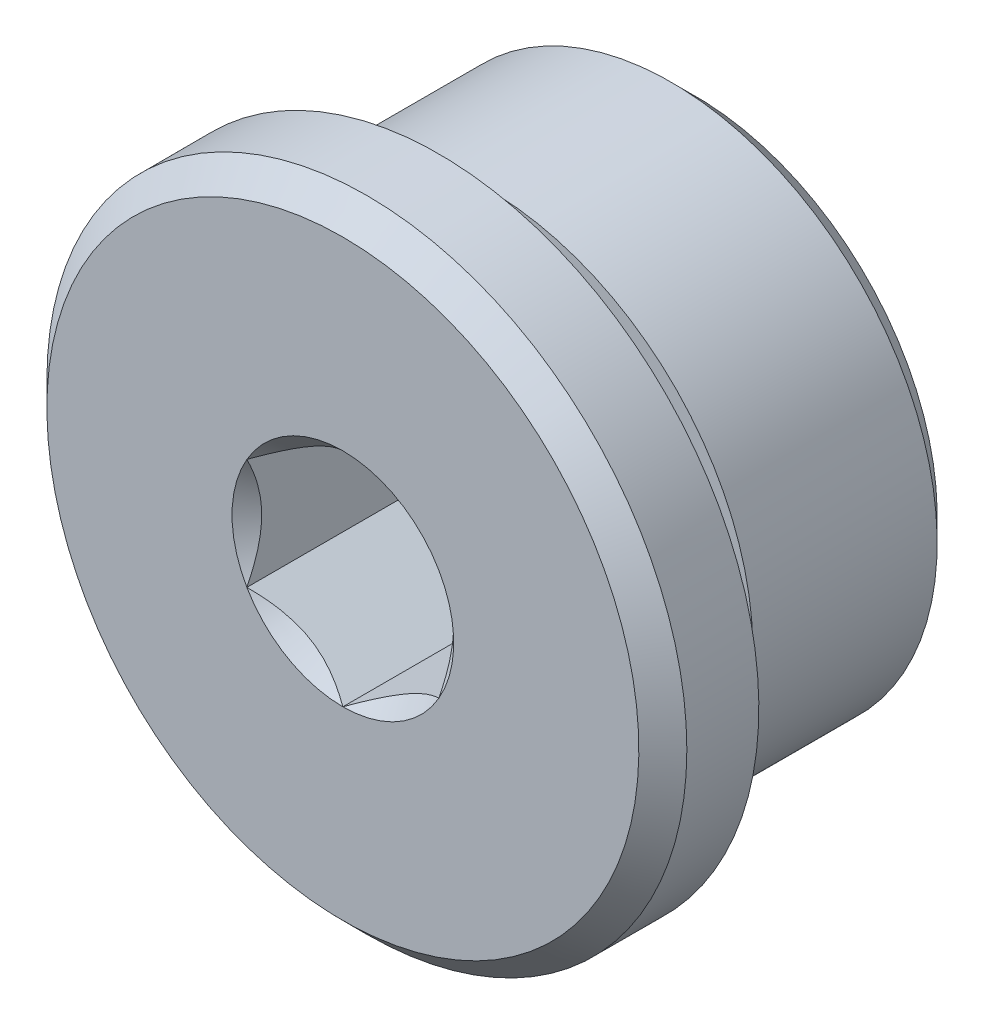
ISO-10303-21;
HEADER;
FILE_DESCRIPTION(('STEP AP214'),'2;1');
FILE_NAME('part.step','',(''),(''),'','','');
FILE_SCHEMA(('AUTOMOTIVE_DESIGN { 1 0 10303 214 1 1 1 1 }'));
ENDSEC;
DATA;
#1=APPLICATION_CONTEXT('core data for automotive mechanical design processes');
#2=APPLICATION_PROTOCOL_DEFINITION('international standard','automotive_design',2000,#1);
#3=PRODUCT_CONTEXT('',#1,'mechanical');
#4=PRODUCT('Part','Part','',(#3));
#5=PRODUCT_RELATED_PRODUCT_CATEGORY('part','',(#4));
#6=PRODUCT_DEFINITION_FORMATION('','',#4);
#7=PRODUCT_DEFINITION_CONTEXT('part definition',#1,'design');
#8=PRODUCT_DEFINITION('design','',#6,#7);
#9=PRODUCT_DEFINITION_SHAPE('','',#8);
#10=(LENGTH_UNIT() NAMED_UNIT(*) SI_UNIT(.MILLI.,.METRE.));
#11=(NAMED_UNIT(*) PLANE_ANGLE_UNIT() SI_UNIT($,.RADIAN.));
#12=(NAMED_UNIT(*) SI_UNIT($,.STERADIAN.) SOLID_ANGLE_UNIT());
#13=UNCERTAINTY_MEASURE_WITH_UNIT(LENGTH_MEASURE(1.E-05),#10,'distance_accuracy_value','');
#14=(GEOMETRIC_REPRESENTATION_CONTEXT(3) GLOBAL_UNCERTAINTY_ASSIGNED_CONTEXT((#13)) GLOBAL_UNIT_ASSIGNED_CONTEXT((#10,
#11,#12)) REPRESENTATION_CONTEXT('',''));
#15=CARTESIAN_POINT('',(0.,0.,0.));
#16=DIRECTION('',(0.,0.,1.));
#17=DIRECTION('',(1.,0.,0.));
#18=AXIS2_PLACEMENT_3D('',#15,#16,#17);
#19=CARTESIAN_POINT('',(0.,0.,-4.));
#20=DIRECTION('',(0.,0.,1.));
#21=DIRECTION('',(0.,-1.,0.));
#22=AXIS2_PLACEMENT_3D('',#19,#20,#21);
#23=PLANE('',#22);
#24=DIRECTION('',(-0.866025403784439,0.5,0.));
#25=VECTOR('',#24,1.);
#26=CARTESIAN_POINT('',(6.,3.46410161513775,-4.));
#27=LINE('',#26,#25);
#28=CARTESIAN_POINT('',(6.,3.46410161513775,-4.));
#29=VERTEX_POINT('',#28);
#30=CARTESIAN_POINT('',(0.,6.92820323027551,-4.));
#31=VERTEX_POINT('',#30);
#32=EDGE_CURVE('E64',#29,#31,#27,.T.);
#33=ORIENTED_EDGE('',*,*,#32,.T.);
#34=DIRECTION('',(-0.866025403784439,-0.5,0.));
#35=VECTOR('',#34,1.);
#36=CARTESIAN_POINT('',(0.,6.92820323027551,-4.));
#37=LINE('',#36,#35);
#38=CARTESIAN_POINT('',(-6.,3.46410161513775,-4.));
#39=VERTEX_POINT('',#38);
#40=EDGE_CURVE('E78',#31,#39,#37,.T.);
#41=ORIENTED_EDGE('',*,*,#40,.T.);
#42=DIRECTION('',(0.,-1.,0.));
#43=VECTOR('',#42,1.);
#44=CARTESIAN_POINT('',(-6.,3.46410161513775,-4.));
#45=LINE('',#44,#43);
#46=CARTESIAN_POINT('',(-6.,-3.46410161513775,-4.));
#47=VERTEX_POINT('',#46);
#48=EDGE_CURVE('E81',#39,#47,#45,.T.);
#49=ORIENTED_EDGE('',*,*,#48,.T.);
#50=DIRECTION('',(0.866025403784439,-0.5,0.));
#51=VECTOR('',#50,1.);
#52=CARTESIAN_POINT('',(-6.,-3.46410161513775,-4.));
#53=LINE('',#52,#51);
#54=CARTESIAN_POINT('',(0.,-6.92820323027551,-4.));
#55=VERTEX_POINT('',#54);
#56=EDGE_CURVE('E96',#47,#55,#53,.T.);
#57=ORIENTED_EDGE('',*,*,#56,.T.);
#58=DIRECTION('',(0.866025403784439,0.5,0.));
#59=VECTOR('',#58,1.);
#60=CARTESIAN_POINT('',(0.,-6.92820323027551,-4.));
#61=LINE('',#60,#59);
#62=CARTESIAN_POINT('',(6.,-3.46410161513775,-4.));
#63=VERTEX_POINT('',#62);
#64=EDGE_CURVE('E272',#55,#63,#61,.T.);
#65=ORIENTED_EDGE('',*,*,#64,.T.);
#66=DIRECTION('',(0.,1.,0.));
#67=VECTOR('',#66,1.);
#68=CARTESIAN_POINT('',(6.,-3.46410161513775,-4.));
#69=LINE('',#68,#67);
#70=EDGE_CURVE('E69',#63,#29,#69,.T.);
#71=ORIENTED_EDGE('',*,*,#70,.T.);
#72=EDGE_LOOP('',(#33,#41,#49,#57,#65,#71));
#73=FACE_BOUND('',#72,.T.);
#74=ADVANCED_FACE('F14',(#73),#23,.T.);
#75=CARTESIAN_POINT('',(0.,6.92820323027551,-4.));
#76=DIRECTION('',(-0.5,0.866025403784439,0.));
#77=DIRECTION('',(-0.866025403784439,-0.5,0.));
#78=AXIS2_PLACEMENT_3D('',#75,#76,#77);
#79=PLANE('',#78);
#80=ORIENTED_EDGE('',*,*,#40,.F.);
#81=DIRECTION('',(0.,0.,1.));
#82=VECTOR('',#81,1.);
#83=CARTESIAN_POINT('',(0.,6.92820323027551,-4.));
#84=LINE('',#83,#82);
#85=CARTESIAN_POINT('',(0.,6.92820323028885,5.99999999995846));
#86=VERTEX_POINT('',#85);
#87=EDGE_CURVE('E56',#31,#86,#84,.T.);
#88=ORIENTED_EDGE('',*,*,#87,.T.);
#89=CARTESIAN_POINT('',(2.05178151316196E-11,6.92820323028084,5.99999999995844));
#90=CARTESIAN_POINT('',(-0.103160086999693,6.86864372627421,5.94044943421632));
#91=CARTESIAN_POINT('',(-0.207113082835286,6.80862643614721,5.88272649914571));
#92=CARTESIAN_POINT('',(-0.416760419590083,6.68758648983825,5.77149180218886));
#93=CARTESIAN_POINT('',(-0.522455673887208,6.62656330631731,5.71798233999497));
#94=CARTESIAN_POINT('',(-0.843369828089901,6.44128343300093,5.5641518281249));
#95=CARTESIAN_POINT('',(-1.06130524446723,6.31545836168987,5.471184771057));
#96=CARTESIAN_POINT('',(-1.5007892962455,6.06172212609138,5.31198561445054));
#97=CARTESIAN_POINT('',(-1.72222563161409,5.93387579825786,5.24535248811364));
#98=CARTESIAN_POINT('',(-2.05802017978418,5.74000472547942,5.16827472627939));
#99=CARTESIAN_POINT('',(-2.170446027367,5.67509563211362,5.14640443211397));
#100=CARTESIAN_POINT('',(-2.3962495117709,5.54472792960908,5.1107826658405));
#101=CARTESIAN_POINT('',(-2.50962700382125,5.47926940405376,5.0970299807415));
#102=CARTESIAN_POINT('',(-2.78592219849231,5.31975029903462,5.07397102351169));
#103=CARTESIAN_POINT('',(-2.94913761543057,5.22551783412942,5.06913349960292));
#104=CARTESIAN_POINT('',(-3.275274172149,5.03722280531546,5.07725752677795));
#105=CARTESIAN_POINT('',(-3.43819518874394,4.94316031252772,5.09022531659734));
#106=CARTESIAN_POINT('',(-3.76250111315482,4.75592219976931,5.13319556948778));
#107=CARTESIAN_POINT('',(-3.92388409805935,4.66274768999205,5.16321707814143));
#108=CARTESIAN_POINT('',(-4.24387624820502,4.47800013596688,5.23866263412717));
#109=CARTESIAN_POINT('',(-4.40248562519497,4.38642696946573,5.28408550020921));
#110=CARTESIAN_POINT('',(-4.68402639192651,4.22387933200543,5.37752750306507));
#111=CARTESIAN_POINT('',(-4.80758157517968,4.15254471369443,5.42308774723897));
#112=CARTESIAN_POINT('',(-5.0524743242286,4.01115581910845,5.52154905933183));
#113=CARTESIAN_POINT('',(-5.17381182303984,3.94110158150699,5.57445034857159));
#114=CARTESIAN_POINT('',(-5.41388699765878,3.802494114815,5.68640817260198));
#115=CARTESIAN_POINT('',(-5.53263150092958,3.73393694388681,5.74544534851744));
#116=CARTESIAN_POINT('',(-5.76792204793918,3.59809188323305,5.86890010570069));
#117=CARTESIAN_POINT('',(-5.88446938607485,3.53080324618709,5.93331438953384));
#118=CARTESIAN_POINT('',(-6.00000000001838,3.46410161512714,5.99999999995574));
#119=B_SPLINE_CURVE_WITH_KNOTS('',3,(#89,#90,#91,#92,#93,#94,#95,#96,#97,#98,#99,#100,#101,#102,
#103,#104,#105,#106,#107,#108,#109,#110,#111,#112,#113,#114,#115,#116,#117,#118),.UNSPECIFIED.,
.F.,.F.,(4,2,2,2,2,2,2,2,2,2,2,2,2,2,4),(0.,0.399501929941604,0.79922041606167,1.60297198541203,
2.39396269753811,2.78868247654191,3.18334325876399,3.74804549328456,4.31294564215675,
4.87847791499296,5.44396682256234,5.89305802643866,6.34216277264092,6.78989128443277,
7.23734722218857),.UNSPECIFIED.);
#120=CARTESIAN_POINT('',(-6.00000000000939,3.46410161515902,5.99999999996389));
#121=VERTEX_POINT('',#120);
#122=EDGE_CURVE('E17',#86,#121,#119,.T.);
#123=ORIENTED_EDGE('',*,*,#122,.T.);
#124=DIRECTION('',(0.,0.,1.));
#125=VECTOR('',#124,1.);
#126=CARTESIAN_POINT('',(-6.,3.46410161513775,-4.));
#127=LINE('',#126,#125);
#128=EDGE_CURVE('E83',#121,#39,#127,.F.);
#129=ORIENTED_EDGE('',*,*,#128,.T.);
#130=EDGE_LOOP('',(#80,#88,#123,#129));
#131=FACE_BOUND('',#130,.T.);
#132=ADVANCED_FACE('F86',(#131),#79,.F.);
#133=CARTESIAN_POINT('',(-6.,3.46410161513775,-4.));
#134=DIRECTION('',(-1.,0.,0.));
#135=DIRECTION('',(0.,-1.,0.));
#136=AXIS2_PLACEMENT_3D('',#133,#134,#135);
#137=PLANE('',#136);
#138=ORIENTED_EDGE('',*,*,#48,.F.);
#139=ORIENTED_EDGE('',*,*,#128,.F.);
#140=CARTESIAN_POINT('',(-5.99999999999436,3.46410161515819,5.99999999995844));
#141=CARTESIAN_POINT('',(-5.99999999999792,3.34498260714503,5.94044943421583));
#142=CARTESIAN_POINT('',(-5.99999999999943,3.22494802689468,5.88272649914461));
#143=CARTESIAN_POINT('',(-6.00000000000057,2.98286813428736,5.77149180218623));
#144=CARTESIAN_POINT('',(-6.0000000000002,2.86082176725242,5.71798233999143));
#145=CARTESIAN_POINT('',(-5.9999999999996,2.49026202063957,5.56415182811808));
#146=CARTESIAN_POINT('',(-5.9999999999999,2.23861187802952,5.4711847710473));
#147=CARTESIAN_POINT('',(-6.0000000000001,1.73113940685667,5.31198561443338));
#148=CARTESIAN_POINT('',(-6.00000000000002,1.47544675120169,5.24535248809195));
#149=CARTESIAN_POINT('',(-5.99999999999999,1.08770460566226,5.16827472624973));
#150=CARTESIAN_POINT('',(-6.,0.957886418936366,5.14640443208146));
#151=CARTESIAN_POINT('',(-6.,0.697151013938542,5.11078266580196));
#152=CARTESIAN_POINT('',(-6.,0.566233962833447,5.09702998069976));
#153=CARTESIAN_POINT('',(-6.,0.247195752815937,5.07397102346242));
#154=CARTESIAN_POINT('',(-6.,0.0587308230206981,5.06913349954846));
#155=CARTESIAN_POINT('',(-6.,-0.317859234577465,5.07725752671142));
#156=CARTESIAN_POINT('',(-6.,-0.505984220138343,5.09022531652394));
#157=CARTESIAN_POINT('',(-6.,-0.880460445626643,5.13319556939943));
#158=CARTESIAN_POINT('',(-6.,-1.06680946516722,5.16321707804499));
#159=CARTESIAN_POINT('',(-6.,-1.43630457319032,5.23866263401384));
#160=CARTESIAN_POINT('',(-6.,-1.61945090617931,5.28408550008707));
#161=CARTESIAN_POINT('',(-6.,-1.94454618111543,5.37752750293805));
#162=CARTESIAN_POINT('',(-6.,-2.08721541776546,5.4230877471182));
#163=CARTESIAN_POINT('',(-6.,-2.36999320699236,5.5215490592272));
#164=CARTESIAN_POINT('',(-6.,-2.51010168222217,5.57445034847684));
#165=CARTESIAN_POINT('',(-6.,-2.78731661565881,5.68640817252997));
#166=CARTESIAN_POINT('',(-6.,-2.92443095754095,5.74544534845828));
#167=CARTESIAN_POINT('',(-6.,-3.19612107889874,5.86890010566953));
#168=CARTESIAN_POINT('',(-6.,-3.33069835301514,5.93331438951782));
#169=CARTESIAN_POINT('',(-6.,-3.46410161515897,5.99999999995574));
#170=B_SPLINE_CURVE_WITH_KNOTS('',3,(#140,#141,#142,#143,#144,#145,#146,#147,#148,#149,#150,
#151,#152,#153,#154,#155,#156,#157,#158,#159,#160,#161,#162,#163,#164,#165,#166,#167,#168,#169),
.UNSPECIFIED.,.F.,.F.,(4,2,2,2,2,2,2,2,2,2,2,2,2,2,4),(0.,0.399501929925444,0.799220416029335,
1.60297198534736,2.3939626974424,2.7886824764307,3.18334325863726,3.74804549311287,
4.31294564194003,4.87847791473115,5.44396682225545,5.89305802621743,6.3421627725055,
6.78989128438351,7.23734722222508),.UNSPECIFIED.);
#171=CARTESIAN_POINT('',(-6.00000000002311,-3.46410161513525,5.99999999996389));
#172=VERTEX_POINT('',#171);
#173=EDGE_CURVE('E204',#121,#172,#170,.T.);
#174=ORIENTED_EDGE('',*,*,#173,.T.);
#175=DIRECTION('',(0.,0.,1.));
#176=VECTOR('',#175,1.);
#177=CARTESIAN_POINT('',(-6.,-3.46410161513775,-4.));
#178=LINE('',#177,#176);
#179=EDGE_CURVE('E93',#172,#47,#178,.F.);
#180=ORIENTED_EDGE('',*,*,#179,.T.);
#181=EDGE_LOOP('',(#138,#139,#174,#180));
#182=FACE_BOUND('',#181,.T.);
#183=ADVANCED_FACE('F91',(#182),#137,.F.);
#184=CARTESIAN_POINT('',(-6.,-3.46410161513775,-4.));
#185=DIRECTION('',(-0.5,-0.866025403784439,0.));
#186=DIRECTION('',(0.866025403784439,-0.5,0.));
#187=AXIS2_PLACEMENT_3D('',#184,#185,#186);
#188=PLANE('',#187);
#189=ORIENTED_EDGE('',*,*,#56,.F.);
#190=ORIENTED_EDGE('',*,*,#179,.F.);
#191=CARTESIAN_POINT('',(-6.00000000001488,-3.46410161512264,5.99999999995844));
#192=CARTESIAN_POINT('',(-5.89683991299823,-3.52366111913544,5.94044943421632));
#193=CARTESIAN_POINT('',(-5.79288691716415,-3.58367840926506,5.88272649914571));
#194=CARTESIAN_POINT('',(-5.58323958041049,-3.70471835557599,5.77149180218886));
#195=CARTESIAN_POINT('',(-5.477544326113,-3.76574153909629,5.71798233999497));
#196=CARTESIAN_POINT('',(-5.1566301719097,-3.95102141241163,5.5641518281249));
#197=CARTESIAN_POINT('',(-4.93869475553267,-4.07684648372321,5.471184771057));
#198=CARTESIAN_POINT('',(-4.49921070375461,-4.33058271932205,5.31198561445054));
#199=CARTESIAN_POINT('',(-4.27777436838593,-4.45842904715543,5.24535248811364));
#200=CARTESIAN_POINT('',(-3.94197982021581,-4.65230011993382,5.16827472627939));
#201=CARTESIAN_POINT('',(-3.829553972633,-4.71720921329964,5.14640443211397));
#202=CARTESIAN_POINT('',(-3.60375048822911,-4.84757691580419,5.1107826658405));
#203=CARTESIAN_POINT('',(-3.49037299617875,-4.9130354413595,5.0970299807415));
#204=CARTESIAN_POINT('',(-3.21407780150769,-5.07255454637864,5.07397102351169));
#205=CARTESIAN_POINT('',(-3.05086238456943,-5.16678701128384,5.06913349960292));
#206=CARTESIAN_POINT('',(-2.724725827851,-5.3550820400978,5.07725752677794));
#207=CARTESIAN_POINT('',(-2.56180481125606,-5.44914453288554,5.09022531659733));
#208=CARTESIAN_POINT('',(-2.23749888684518,-5.63638264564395,5.13319556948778));
#209=CARTESIAN_POINT('',(-2.07611590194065,-5.72955715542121,5.16321707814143));
#210=CARTESIAN_POINT('',(-1.75612375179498,-5.91430470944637,5.23866263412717));
#211=CARTESIAN_POINT('',(-1.59751437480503,-6.00587787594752,5.2840855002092));
#212=CARTESIAN_POINT('',(-1.31597360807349,-6.16842551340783,5.37752750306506));
#213=CARTESIAN_POINT('',(-1.19241842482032,-6.23976013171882,5.42308774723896));
#214=CARTESIAN_POINT('',(-0.947525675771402,-6.3811490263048,5.52154905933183));
#215=CARTESIAN_POINT('',(-0.826188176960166,-6.45120326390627,5.57445034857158));
#216=CARTESIAN_POINT('',(-0.586113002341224,-6.58981073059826,5.68640817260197));
#217=CARTESIAN_POINT('',(-0.467368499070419,-6.65836790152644,5.74544534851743));
#218=CARTESIAN_POINT('',(-0.232077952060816,-6.79421296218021,5.86890010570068));
#219=CARTESIAN_POINT('',(-0.115530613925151,-6.86150159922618,5.93331438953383));
#220=CARTESIAN_POINT('',(1.83817172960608E-11,-6.92820323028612,5.99999999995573));
#221=B_SPLINE_CURVE_WITH_KNOTS('',3,(#191,#192,#193,#194,#195,#196,#197,#198,#199,#200,#201,
#202,#203,#204,#205,#206,#207,#208,#209,#210,#211,#212,#213,#214,#215,#216,#217,#218,#219,#220),
.UNSPECIFIED.,.F.,.F.,(4,2,2,2,2,2,2,2,2,2,2,2,2,2,4),(0.,0.399501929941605,0.799220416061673,
1.60297198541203,2.39396269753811,2.78868247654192,3.183343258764,3.74804549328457,
4.31294564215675,4.87847791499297,5.44396682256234,5.89305802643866,6.34216277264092,
6.78989128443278,7.23734722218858),.UNSPECIFIED.);
#222=CARTESIAN_POINT('',(-1.37136257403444E-11,-6.92820323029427,5.99999999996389));
#223=VERTEX_POINT('',#222);
#224=EDGE_CURVE('E184',#172,#223,#221,.T.);
#225=ORIENTED_EDGE('',*,*,#224,.T.);
#226=DIRECTION('',(0.,0.,1.));
#227=VECTOR('',#226,1.);
#228=CARTESIAN_POINT('',(0.,-6.92820323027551,-4.));
#229=LINE('',#228,#227);
#230=EDGE_CURVE('E273',#223,#55,#229,.F.);
#231=ORIENTED_EDGE('',*,*,#230,.T.);
#232=EDGE_LOOP('',(#189,#190,#225,#231));
#233=FACE_BOUND('',#232,.T.);
#234=ADVANCED_FACE('F194',(#233),#188,.F.);
#235=CARTESIAN_POINT('',(0.,-6.92820323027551,-4.));
#236=DIRECTION('',(0.5,-0.866025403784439,0.));
#237=DIRECTION('',(0.866025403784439,0.5,0.));
#238=AXIS2_PLACEMENT_3D('',#235,#236,#237);
#239=PLANE('',#238);
#240=ORIENTED_EDGE('',*,*,#64,.F.);
#241=ORIENTED_EDGE('',*,*,#230,.F.);
#242=CARTESIAN_POINT('',(-2.05254071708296E-11,-6.92820323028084,5.99999999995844));
#243=CARTESIAN_POINT('',(0.103160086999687,-6.86864372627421,5.94044943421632));
#244=CARTESIAN_POINT('',(0.207113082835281,-6.80862643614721,5.88272649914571));
#245=CARTESIAN_POINT('',(0.416760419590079,-6.68758648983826,5.77149180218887));
#246=CARTESIAN_POINT('',(0.522455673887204,-6.62656330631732,5.71798233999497));
#247=CARTESIAN_POINT('',(0.843369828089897,-6.44128343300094,5.5641518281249));
#248=CARTESIAN_POINT('',(1.06130524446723,-6.31545836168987,5.471184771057));
#249=CARTESIAN_POINT('',(1.5007892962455,-6.06172212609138,5.31198561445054));
#250=CARTESIAN_POINT('',(1.72222563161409,-5.93387579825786,5.24535248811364));
#251=CARTESIAN_POINT('',(2.05802017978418,-5.74000472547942,5.16827472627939));
#252=CARTESIAN_POINT('',(2.170446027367,-5.67509563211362,5.14640443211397));
#253=CARTESIAN_POINT('',(2.39624951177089,-5.54472792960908,5.1107826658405));
#254=CARTESIAN_POINT('',(2.50962700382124,-5.47926940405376,5.0970299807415));
#255=CARTESIAN_POINT('',(2.7859221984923,-5.31975029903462,5.07397102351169));
#256=CARTESIAN_POINT('',(2.94913761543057,-5.22551783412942,5.06913349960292));
#257=CARTESIAN_POINT('',(3.275274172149,-5.03722280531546,5.07725752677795));
#258=CARTESIAN_POINT('',(3.43819518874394,-4.94316031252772,5.09022531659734));
#259=CARTESIAN_POINT('',(3.76250111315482,-4.75592219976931,5.13319556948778));
#260=CARTESIAN_POINT('',(3.92388409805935,-4.66274768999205,5.16321707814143));
#261=CARTESIAN_POINT('',(4.24387624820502,-4.47800013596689,5.23866263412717));
#262=CARTESIAN_POINT('',(4.40248562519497,-4.38642696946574,5.28408550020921));
#263=CARTESIAN_POINT('',(4.68402639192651,-4.22387933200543,5.37752750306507));
#264=CARTESIAN_POINT('',(4.80758157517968,-4.15254471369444,5.42308774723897));
#265=CARTESIAN_POINT('',(5.0524743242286,-4.01115581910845,5.52154905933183));
#266=CARTESIAN_POINT('',(5.17381182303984,-3.94110158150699,5.57445034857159));
#267=CARTESIAN_POINT('',(5.41388699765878,-3.802494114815,5.68640817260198));
#268=CARTESIAN_POINT('',(5.53263150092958,-3.73393694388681,5.74544534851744));
#269=CARTESIAN_POINT('',(5.76792204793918,-3.59809188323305,5.86890010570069));
#270=CARTESIAN_POINT('',(5.88446938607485,-3.53080324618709,5.93331438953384));
#271=CARTESIAN_POINT('',(6.00000000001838,-3.46410161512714,5.99999999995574));
#272=B_SPLINE_CURVE_WITH_KNOTS('',3,(#242,#243,#244,#245,#246,#247,#248,#249,#250,#251,#252,
#253,#254,#255,#256,#257,#258,#259,#260,#261,#262,#263,#264,#265,#266,#267,#268,#269,#270,#271),
.UNSPECIFIED.,.F.,.F.,(4,2,2,2,2,2,2,2,2,2,2,2,2,2,4),(0.,0.399501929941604,0.799220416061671,
1.60297198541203,2.39396269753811,2.78868247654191,3.18334325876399,3.74804549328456,
4.31294564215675,4.87847791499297,5.44396682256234,5.89305802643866,6.34216277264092,
6.78989128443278,7.23734722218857),.UNSPECIFIED.);
#273=CARTESIAN_POINT('',(6.00000000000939,-3.46410161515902,5.99999999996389));
#274=VERTEX_POINT('',#273);
#275=EDGE_CURVE('E177',#223,#274,#272,.T.);
#276=ORIENTED_EDGE('',*,*,#275,.T.);
#277=DIRECTION('',(0.,0.,1.));
#278=VECTOR('',#277,1.);
#279=CARTESIAN_POINT('',(6.,-3.46410161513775,-4.));
#280=LINE('',#279,#278);
#281=EDGE_CURVE('E269',#274,#63,#280,.F.);
#282=ORIENTED_EDGE('',*,*,#281,.T.);
#283=EDGE_LOOP('',(#240,#241,#276,#282));
#284=FACE_BOUND('',#283,.T.);
#285=ADVANCED_FACE('F190',(#284),#239,.F.);
#286=CARTESIAN_POINT('',(6.,-3.46410161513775,-4.));
#287=DIRECTION('',(1.,0.,0.));
#288=DIRECTION('',(0.,1.,0.));
#289=AXIS2_PLACEMENT_3D('',#286,#287,#288);
#290=PLANE('',#289);
#291=ORIENTED_EDGE('',*,*,#70,.F.);
#292=ORIENTED_EDGE('',*,*,#281,.F.);
#293=CARTESIAN_POINT('',(5.99999999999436,-3.46410161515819,5.99999999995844));
#294=CARTESIAN_POINT('',(5.99999999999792,-3.34498260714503,5.94044943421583));
#295=CARTESIAN_POINT('',(5.99999999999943,-3.22494802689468,5.88272649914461));
#296=CARTESIAN_POINT('',(6.00000000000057,-2.98286813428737,5.77149180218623));
#297=CARTESIAN_POINT('',(6.0000000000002,-2.86082176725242,5.71798233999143));
#298=CARTESIAN_POINT('',(5.9999999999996,-2.49026202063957,5.56415182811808));
#299=CARTESIAN_POINT('',(5.9999999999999,-2.23861187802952,5.4711847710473));
#300=CARTESIAN_POINT('',(6.0000000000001,-1.73113940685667,5.31198561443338));
#301=CARTESIAN_POINT('',(6.00000000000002,-1.47544675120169,5.24535248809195));
#302=CARTESIAN_POINT('',(5.99999999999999,-1.08770460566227,5.16827472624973));
#303=CARTESIAN_POINT('',(6.,-0.957886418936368,5.14640443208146));
#304=CARTESIAN_POINT('',(6.,-0.697151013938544,5.11078266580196));
#305=CARTESIAN_POINT('',(6.,-0.56623396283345,5.09702998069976));
#306=CARTESIAN_POINT('',(6.,-0.24719575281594,5.07397102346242));
#307=CARTESIAN_POINT('',(6.,-0.0587308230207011,5.06913349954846));
#308=CARTESIAN_POINT('',(6.,0.317859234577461,5.07725752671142));
#309=CARTESIAN_POINT('',(6.,0.505984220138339,5.09022531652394));
#310=CARTESIAN_POINT('',(6.,0.880460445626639,5.13319556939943));
#311=CARTESIAN_POINT('',(6.,1.06680946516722,5.16321707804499));
#312=CARTESIAN_POINT('',(6.,1.43630457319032,5.23866263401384));
#313=CARTESIAN_POINT('',(6.,1.61945090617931,5.28408550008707));
#314=CARTESIAN_POINT('',(6.,1.94454618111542,5.37752750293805));
#315=CARTESIAN_POINT('',(6.,2.08721541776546,5.4230877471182));
#316=CARTESIAN_POINT('',(6.,2.36999320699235,5.52154905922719));
#317=CARTESIAN_POINT('',(6.,2.51010168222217,5.57445034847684));
#318=CARTESIAN_POINT('',(6.,2.7873166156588,5.68640817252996));
#319=CARTESIAN_POINT('',(6.,2.92443095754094,5.74544534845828));
#320=CARTESIAN_POINT('',(6.,3.19612107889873,5.86890010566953));
#321=CARTESIAN_POINT('',(6.,3.33069835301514,5.93331438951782));
#322=CARTESIAN_POINT('',(6.,3.46410161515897,5.99999999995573));
#323=B_SPLINE_CURVE_WITH_KNOTS('',3,(#293,#294,#295,#296,#297,#298,#299,#300,#301,#302,#303,
#304,#305,#306,#307,#308,#309,#310,#311,#312,#313,#314,#315,#316,#317,#318,#319,#320,#321,#322),
.UNSPECIFIED.,.F.,.F.,(4,2,2,2,2,2,2,2,2,2,2,2,2,2,4),(0.,0.399501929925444,0.799220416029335,
1.60297198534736,2.3939626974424,2.7886824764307,3.18334325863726,3.74804549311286,
4.31294564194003,4.87847791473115,5.44396682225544,5.89305802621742,6.34216277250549,
6.7898912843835,7.23734722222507),.UNSPECIFIED.);
#324=CARTESIAN_POINT('',(6.00000000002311,3.46410161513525,5.99999999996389));
#325=VERTEX_POINT('',#324);
#326=EDGE_CURVE('E37',#274,#325,#323,.T.);
#327=ORIENTED_EDGE('',*,*,#326,.T.);
#328=DIRECTION('',(0.,0.,1.));
#329=VECTOR('',#328,1.);
#330=CARTESIAN_POINT('',(6.,3.46410161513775,-4.));
#331=LINE('',#330,#329);
#332=EDGE_CURVE('E267',#325,#29,#331,.F.);
#333=ORIENTED_EDGE('',*,*,#332,.T.);
#334=EDGE_LOOP('',(#291,#292,#327,#333));
#335=FACE_BOUND('',#334,.T.);
#336=ADVANCED_FACE('F193',(#335),#290,.F.);
#337=CARTESIAN_POINT('',(6.,3.46410161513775,-4.));
#338=DIRECTION('',(0.5,0.866025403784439,0.));
#339=DIRECTION('',(-0.866025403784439,0.5,0.));
#340=AXIS2_PLACEMENT_3D('',#337,#338,#339);
#341=PLANE('',#340);
#342=ORIENTED_EDGE('',*,*,#32,.F.);
#343=ORIENTED_EDGE('',*,*,#332,.F.);
#344=CARTESIAN_POINT('',(6.00000000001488,3.46410161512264,5.99999999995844));
#345=CARTESIAN_POINT('',(5.89683991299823,3.52366111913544,5.94044943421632));
#346=CARTESIAN_POINT('',(5.79288691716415,3.58367840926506,5.88272649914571));
#347=CARTESIAN_POINT('',(5.58323958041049,3.70471835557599,5.77149180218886));
#348=CARTESIAN_POINT('',(5.477544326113,3.76574153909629,5.71798233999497));
#349=CARTESIAN_POINT('',(5.15663017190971,3.95102141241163,5.5641518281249));
#350=CARTESIAN_POINT('',(4.93869475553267,4.0768464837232,5.471184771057));
#351=CARTESIAN_POINT('',(4.49921070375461,4.33058271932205,5.31198561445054));
#352=CARTESIAN_POINT('',(4.27777436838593,4.45842904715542,5.24535248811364));
#353=CARTESIAN_POINT('',(3.94197982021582,4.65230011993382,5.16827472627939));
#354=CARTESIAN_POINT('',(3.82955397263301,4.71720921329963,5.14640443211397));
#355=CARTESIAN_POINT('',(3.60375048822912,4.84757691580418,5.1107826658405));
#356=CARTESIAN_POINT('',(3.49037299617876,4.91303544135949,5.0970299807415));
#357=CARTESIAN_POINT('',(3.2140778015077,5.07255454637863,5.07397102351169));
#358=CARTESIAN_POINT('',(3.05086238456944,5.16678701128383,5.06913349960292));
#359=CARTESIAN_POINT('',(2.72472582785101,5.3550820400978,5.07725752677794));
#360=CARTESIAN_POINT('',(2.56180481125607,5.44914453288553,5.09022531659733));
#361=CARTESIAN_POINT('',(2.23749888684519,5.63638264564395,5.13319556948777));
#362=CARTESIAN_POINT('',(2.07611590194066,5.7295571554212,5.16321707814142));
#363=CARTESIAN_POINT('',(1.75612375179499,5.91430470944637,5.23866263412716));
#364=CARTESIAN_POINT('',(1.59751437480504,6.00587787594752,5.2840855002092));
#365=CARTESIAN_POINT('',(1.3159736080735,6.16842551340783,5.37752750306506));
#366=CARTESIAN_POINT('',(1.19241842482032,6.23976013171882,5.42308774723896));
#367=CARTESIAN_POINT('',(0.947525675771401,6.3811490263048,5.52154905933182));
#368=CARTESIAN_POINT('',(0.826188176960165,6.45120326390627,5.57445034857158));
#369=CARTESIAN_POINT('',(0.586113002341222,6.58981073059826,5.68640817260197));
#370=CARTESIAN_POINT('',(0.467368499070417,6.65836790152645,5.74544534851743));
#371=CARTESIAN_POINT('',(0.232077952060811,6.79421296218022,5.86890010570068));
#372=CARTESIAN_POINT('',(0.115530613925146,6.86150159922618,5.93331438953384));
#373=CARTESIAN_POINT('',(-1.83870706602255E-11,6.92820323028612,5.99999999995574));
#374=B_SPLINE_CURVE_WITH_KNOTS('',3,(#344,#345,#346,#347,#348,#349,#350,#351,#352,#353,#354,
#355,#356,#357,#358,#359,#360,#361,#362,#363,#364,#365,#366,#367,#368,#369,#370,#371,#372,#373),
.UNSPECIFIED.,.F.,.F.,(4,2,2,2,2,2,2,2,2,2,2,2,2,2,4),(0.,0.399501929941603,0.799220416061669,
1.60297198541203,2.3939626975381,2.78868247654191,3.18334325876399,3.74804549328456,
4.31294564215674,4.87847791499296,5.44396682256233,5.89305802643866,6.34216277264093,
6.78989128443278,7.23734722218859),.UNSPECIFIED.);
#375=EDGE_CURVE('E140',#325,#86,#374,.T.);
#376=ORIENTED_EDGE('',*,*,#375,.T.);
#377=ORIENTED_EDGE('',*,*,#87,.F.);
#378=EDGE_LOOP('',(#342,#343,#376,#377));
#379=FACE_BOUND('',#378,.T.);
#380=ADVANCED_FACE('F155',(#379),#341,.F.);
#381=CARTESIAN_POINT('',(0.,0.,5.99999999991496));
#382=DIRECTION('',(0.,0.,1.));
#383=DIRECTION('',(-1.,0.,0.));
#384=AXIS2_PLACEMENT_3D('',#381,#382,#383);
#385=CONICAL_SURFACE('',#384,6.92820323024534,0.78539816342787);
#386=ORIENTED_EDGE('',*,*,#122,.F.);
#387=CARTESIAN_POINT('',(0.,0.,5.99999999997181));
#388=DIRECTION('',(0.,0.,1.));
#389=DIRECTION('',(-1.,0.,0.));
#390=AXIS2_PLACEMENT_3D('',#387,#388,#389);
#391=CIRCLE('',#390,6.92820323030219);
#392=EDGE_CURVE('E138',#86,#121,#391,.T.);
#393=ORIENTED_EDGE('',*,*,#392,.T.);
#394=EDGE_LOOP('',(#386,#393));
#395=FACE_BOUND('',#394,.T.);
#396=ADVANCED_FACE('F212',(#395),#385,.F.);
#397=CARTESIAN_POINT('',(0.,0.,5.99999999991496));
#398=DIRECTION('',(0.,0.,1.));
#399=DIRECTION('',(-1.,0.,0.));
#400=AXIS2_PLACEMENT_3D('',#397,#398,#399);
#401=CONICAL_SURFACE('',#400,6.92820323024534,0.785398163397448);
#402=ORIENTED_EDGE('',*,*,#173,.F.);
#403=CARTESIAN_POINT('',(0.,0.,5.99999999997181));
#404=DIRECTION('',(0.,0.,1.));
#405=DIRECTION('',(-1.,0.,0.));
#406=AXIS2_PLACEMENT_3D('',#403,#404,#405);
#407=CIRCLE('',#406,6.92820323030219);
#408=EDGE_CURVE('E135',#121,#172,#407,.T.);
#409=ORIENTED_EDGE('',*,*,#408,.T.);
#410=EDGE_LOOP('',(#402,#409));
#411=FACE_BOUND('',#410,.T.);
#412=ADVANCED_FACE('F209',(#411),#401,.F.);
#413=CARTESIAN_POINT('',(0.,0.,5.99999999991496));
#414=DIRECTION('',(0.,0.,1.));
#415=DIRECTION('',(-1.,0.,0.));
#416=AXIS2_PLACEMENT_3D('',#413,#414,#415);
#417=CONICAL_SURFACE('',#416,6.92820323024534,0.78539816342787);
#418=ORIENTED_EDGE('',*,*,#224,.F.);
#419=CARTESIAN_POINT('',(0.,0.,5.99999999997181));
#420=DIRECTION('',(0.,0.,1.));
#421=DIRECTION('',(-1.,0.,0.));
#422=AXIS2_PLACEMENT_3D('',#419,#420,#421);
#423=CIRCLE('',#422,6.92820323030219);
#424=EDGE_CURVE('E132',#172,#223,#423,.T.);
#425=ORIENTED_EDGE('',*,*,#424,.T.);
#426=EDGE_LOOP('',(#418,#425));
#427=FACE_BOUND('',#426,.T.);
#428=ADVANCED_FACE('F173',(#427),#417,.F.);
#429=CARTESIAN_POINT('',(0.,0.,5.99999999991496));
#430=DIRECTION('',(0.,0.,1.));
#431=DIRECTION('',(-1.,0.,0.));
#432=AXIS2_PLACEMENT_3D('',#429,#430,#431);
#433=CONICAL_SURFACE('',#432,6.92820323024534,0.78539816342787);
#434=ORIENTED_EDGE('',*,*,#275,.F.);
#435=CARTESIAN_POINT('',(0.,0.,5.99999999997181));
#436=DIRECTION('',(0.,0.,1.));
#437=DIRECTION('',(-1.,0.,0.));
#438=AXIS2_PLACEMENT_3D('',#435,#436,#437);
#439=CIRCLE('',#438,6.92820323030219);
#440=EDGE_CURVE('E129',#223,#274,#439,.T.);
#441=ORIENTED_EDGE('',*,*,#440,.T.);
#442=EDGE_LOOP('',(#434,#441));
#443=FACE_BOUND('',#442,.T.);
#444=ADVANCED_FACE('F168',(#443),#433,.F.);
#445=CARTESIAN_POINT('',(0.,0.,5.99999999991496));
#446=DIRECTION('',(0.,0.,1.));
#447=DIRECTION('',(-1.,0.,0.));
#448=AXIS2_PLACEMENT_3D('',#445,#446,#447);
#449=CONICAL_SURFACE('',#448,6.92820323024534,0.785398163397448);
#450=ORIENTED_EDGE('',*,*,#326,.F.);
#451=CARTESIAN_POINT('',(0.,0.,5.99999999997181));
#452=DIRECTION('',(0.,0.,1.));
#453=DIRECTION('',(-1.,0.,0.));
#454=AXIS2_PLACEMENT_3D('',#451,#452,#453);
#455=CIRCLE('',#454,6.92820323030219);
#456=EDGE_CURVE('E126',#274,#325,#455,.T.);
#457=ORIENTED_EDGE('',*,*,#456,.T.);
#458=EDGE_LOOP('',(#450,#457));
#459=FACE_BOUND('',#458,.T.);
#460=ADVANCED_FACE('F162',(#459),#449,.F.);
#461=CARTESIAN_POINT('',(0.,0.,5.99999999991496));
#462=DIRECTION('',(0.,0.,1.));
#463=DIRECTION('',(-1.,0.,0.));
#464=AXIS2_PLACEMENT_3D('',#461,#462,#463);
#465=CONICAL_SURFACE('',#464,6.92820323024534,0.78539816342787);
#466=ORIENTED_EDGE('',*,*,#375,.F.);
#467=CARTESIAN_POINT('',(0.,0.,5.99999999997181));
#468=DIRECTION('',(0.,0.,1.));
#469=DIRECTION('',(-1.,0.,0.));
#470=AXIS2_PLACEMENT_3D('',#467,#468,#469);
#471=CIRCLE('',#470,6.92820323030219);
#472=EDGE_CURVE('E123',#325,#86,#471,.T.);
#473=ORIENTED_EDGE('',*,*,#472,.T.);
#474=EDGE_LOOP('',(#466,#473));
#475=FACE_BOUND('',#474,.T.);
#476=ADVANCED_FACE('F157',(#475),#465,.F.);
#477=CARTESIAN_POINT('',(6.9282032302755,0.,6.));
#478=DIRECTION('',(0.,0.,-1.));
#479=DIRECTION('',(0.,1.,0.));
#480=AXIS2_PLACEMENT_3D('',#477,#478,#479);
#481=PLANE('',#480);
#482=ORIENTED_EDGE('',*,*,#456,.F.);
#483=ORIENTED_EDGE('',*,*,#440,.F.);
#484=ORIENTED_EDGE('',*,*,#424,.F.);
#485=ORIENTED_EDGE('',*,*,#408,.F.);
#486=ORIENTED_EDGE('',*,*,#392,.F.);
#487=ORIENTED_EDGE('',*,*,#472,.F.);
#488=EDGE_LOOP('',(#482,#483,#484,#485,#486,#487));
#489=FACE_BOUND('',#488,.T.);
#490=CARTESIAN_POINT('',(0.,0.,6.));
#491=DIRECTION('',(0.,0.,-1.));
#492=DIRECTION('',(0.,1.,0.));
#493=AXIS2_PLACEMENT_3D('',#490,#491,#492);
#494=CIRCLE('',#493,18.5);
#495=CARTESIAN_POINT('',(0.,18.5,6.));
#496=VERTEX_POINT('',#495);
#497=EDGE_CURVE('E120',#496,#496,#494,.T.);
#498=ORIENTED_EDGE('',*,*,#497,.F.);
#499=EDGE_LOOP('',(#498));
#500=FACE_BOUND('',#499,.T.);
#501=ADVANCED_FACE('F161',(#489,#500),#481,.F.);
#502=CARTESIAN_POINT('',(0.,0.,4.5));
#503=DIRECTION('',(0.,0.,-1.));
#504=DIRECTION('',(0.,1.,0.));
#505=AXIS2_PLACEMENT_3D('',#502,#503,#504);
#506=CONICAL_SURFACE('',#505,20.,0.78539816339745);
#507=ORIENTED_EDGE('',*,*,#497,.T.);
#508=EDGE_LOOP('',(#507));
#509=FACE_BOUND('',#508,.T.);
#510=CARTESIAN_POINT('',(0.,0.,4.5));
#511=DIRECTION('',(0.,0.,1.));
#512=DIRECTION('',(0.,-1.,0.));
#513=AXIS2_PLACEMENT_3D('',#510,#511,#512);
#514=CIRCLE('',#513,20.);
#515=CARTESIAN_POINT('',(0.,-20.,4.5));
#516=VERTEX_POINT('',#515);
#517=EDGE_CURVE('E119',#516,#516,#514,.F.);
#518=ORIENTED_EDGE('',*,*,#517,.F.);
#519=EDGE_LOOP('',(#518));
#520=FACE_BOUND('',#519,.T.);
#521=ADVANCED_FACE('F317',(#509,#520),#506,.T.);
#522=CARTESIAN_POINT('',(0.,0.,-16.));
#523=DIRECTION('',(0.,0.,1.));
#524=DIRECTION('',(0.,-1.,0.));
#525=AXIS2_PLACEMENT_3D('',#522,#523,#524);
#526=CYLINDRICAL_SURFACE('',#525,20.);
#527=ORIENTED_EDGE('',*,*,#517,.T.);
#528=EDGE_LOOP('',(#527));
#529=FACE_BOUND('',#528,.T.);
#530=CARTESIAN_POINT('',(0.,0.,0.));
#531=DIRECTION('',(0.,0.,1.));
#532=DIRECTION('',(0.,-1.,0.));
#533=AXIS2_PLACEMENT_3D('',#530,#531,#532);
#534=CIRCLE('',#533,20.);
#535=CARTESIAN_POINT('',(0.,-20.,0.));
#536=VERTEX_POINT('',#535);
#537=EDGE_CURVE('E116',#536,#536,#534,.T.);
#538=ORIENTED_EDGE('',*,*,#537,.T.);
#539=EDGE_LOOP('',(#538));
#540=FACE_BOUND('',#539,.T.);
#541=ADVANCED_FACE('F323',(#529,#540),#526,.T.);
#542=CARTESIAN_POINT('',(20.,0.,0.));
#543=DIRECTION('',(0.,0.,1.));
#544=DIRECTION('',(0.,-1.,0.));
#545=AXIS2_PLACEMENT_3D('',#542,#543,#544);
#546=PLANE('',#545);
#547=ORIENTED_EDGE('',*,*,#537,.F.);
#548=EDGE_LOOP('',(#547));
#549=FACE_BOUND('',#548,.T.);
#550=CARTESIAN_POINT('',(0.,0.,0.));
#551=DIRECTION('',(0.,0.,-1.));
#552=DIRECTION('',(0.,1.,0.));
#553=AXIS2_PLACEMENT_3D('',#550,#551,#552);
#554=CIRCLE('',#553,17.4747448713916);
#555=CARTESIAN_POINT('',(0.,17.4747448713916,0.));
#556=VERTEX_POINT('',#555);
#557=EDGE_CURVE('E113',#556,#556,#554,.T.);
#558=ORIENTED_EDGE('',*,*,#557,.F.);
#559=EDGE_LOOP('',(#558));
#560=FACE_BOUND('',#559,.T.);
#561=ADVANCED_FACE('F254',(#549,#560),#546,.F.);
#562=CARTESIAN_POINT('',(0.,0.,0.25));
#563=DIRECTION('',(0.,0.,-1.));
#564=DIRECTION('',(0.,1.,0.));
#565=AXIS2_PLACEMENT_3D('',#562,#563,#564);
#566=TOROIDAL_SURFACE('',#565,16.25,1.25);
#567=CARTESIAN_POINT('',(0.,0.,0.));
#568=DIRECTION('',(0.,0.,-1.));
#569=DIRECTION('',(0.,1.,0.));
#570=AXIS2_PLACEMENT_3D('',#567,#568,#569);
#571=CIRCLE('',#570,15.0252551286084);
#572=CARTESIAN_POINT('',(0.,15.0252551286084,0.));
#573=VERTEX_POINT('',#572);
#574=EDGE_CURVE('E110',#573,#573,#571,.F.);
#575=ORIENTED_EDGE('',*,*,#574,.T.);
#576=EDGE_LOOP('',(#575));
#577=FACE_BOUND('',#576,.T.);
#578=ORIENTED_EDGE('',*,*,#557,.T.);
#579=EDGE_LOOP('',(#578));
#580=FACE_BOUND('',#579,.T.);
#581=ADVANCED_FACE('F249',(#577,#580),#566,.T.);
#582=CARTESIAN_POINT('',(20.,0.,0.));
#583=DIRECTION('',(0.,0.,1.));
#584=DIRECTION('',(0.,-1.,0.));
#585=AXIS2_PLACEMENT_3D('',#582,#583,#584);
#586=PLANE('',#585);
#587=ORIENTED_EDGE('',*,*,#574,.F.);
#588=EDGE_LOOP('',(#587));
#589=FACE_BOUND('',#588,.T.);
#590=CARTESIAN_POINT('',(0.,0.,0.));
#591=DIRECTION('',(0.,0.,1.));
#592=DIRECTION('',(0.,-1.,0.));
#593=AXIS2_PLACEMENT_3D('',#590,#591,#592);
#594=CIRCLE('',#593,15.);
#595=CARTESIAN_POINT('',(0.,-15.,0.));
#596=VERTEX_POINT('',#595);
#597=EDGE_CURVE('E107',#596,#596,#594,.F.);
#598=ORIENTED_EDGE('',*,*,#597,.F.);
#599=EDGE_LOOP('',(#598));
#600=FACE_BOUND('',#599,.T.);
#601=ADVANCED_FACE('F245',(#589,#600),#586,.F.);
#602=CARTESIAN_POINT('',(15.1455,0.,-16.));
#603=DIRECTION('',(0.,0.,1.));
#604=DIRECTION('',(0.,-1.,0.));
#605=AXIS2_PLACEMENT_3D('',#602,#603,#604);
#606=PLANE('',#605);
#607=CARTESIAN_POINT('',(0.,0.,-16.));
#608=DIRECTION('',(0.,0.,1.));
#609=DIRECTION('',(0.,-1.,0.));
#610=AXIS2_PLACEMENT_3D('',#607,#608,#609);
#611=CIRCLE('',#610,15.1455);
#612=CARTESIAN_POINT('',(0.,-15.1455,-16.));
#613=VERTEX_POINT('',#612);
#614=EDGE_CURVE('E104',#613,#613,#611,.T.);
#615=ORIENTED_EDGE('',*,*,#614,.F.);
#616=EDGE_LOOP('',(#615));
#617=FACE_BOUND('',#616,.T.);
#618=ADVANCED_FACE('F241',(#617),#606,.F.);
#619=CARTESIAN_POINT('',(0.,0.,-16.));
#620=DIRECTION('',(0.,0.,1.));
#621=DIRECTION('',(0.,-1.,0.));
#622=AXIS2_PLACEMENT_3D('',#619,#620,#621);
#623=CYLINDRICAL_SURFACE('',#622,15.);
#624=ORIENTED_EDGE('',*,*,#597,.T.);
#625=EDGE_LOOP('',(#624));
#626=FACE_BOUND('',#625,.T.);
#627=CARTESIAN_POINT('',(0.,0.,-3.));
#628=DIRECTION('',(0.,0.,1.));
#629=DIRECTION('',(0.,-1.,0.));
#630=AXIS2_PLACEMENT_3D('',#627,#628,#629);
#631=CIRCLE('',#630,15.);
#632=CARTESIAN_POINT('',(0.,-15.,-3.));
#633=VERTEX_POINT('',#632);
#634=EDGE_CURVE('E101',#633,#633,#631,.T.);
#635=ORIENTED_EDGE('',*,*,#634,.T.);
#636=EDGE_LOOP('',(#635));
#637=FACE_BOUND('',#636,.T.);
#638=ADVANCED_FACE('F237',(#626,#637),#623,.T.);
#639=CARTESIAN_POINT('',(0.,0.,-14.521));
#640=DIRECTION('',(0.,0.,1.));
#641=DIRECTION('',(0.,-1.,0.));
#642=AXIS2_PLACEMENT_3D('',#639,#640,#641);
#643=CONICAL_SURFACE('',#642,16.6245,0.785398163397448);
#644=CARTESIAN_POINT('',(0.,0.,-14.521));
#645=DIRECTION('',(0.,0.,1.));
#646=DIRECTION('',(0.,-1.,0.));
#647=AXIS2_PLACEMENT_3D('',#644,#645,#646);
#648=CIRCLE('',#647,16.6245);
#649=CARTESIAN_POINT('',(0.,-16.6245,-14.521));
#650=VERTEX_POINT('',#649);
#651=EDGE_CURVE('E28',#650,#650,#648,.T.);
#652=ORIENTED_EDGE('',*,*,#651,.F.);
#653=EDGE_LOOP('',(#652));
#654=FACE_BOUND('',#653,.T.);
#655=ORIENTED_EDGE('',*,*,#614,.T.);
#656=EDGE_LOOP('',(#655));
#657=FACE_BOUND('',#656,.T.);
#658=ADVANCED_FACE('F230',(#654,#657),#643,.T.);
#659=CARTESIAN_POINT('',(15.,0.,-3.));
#660=DIRECTION('',(0.,0.,-1.));
#661=DIRECTION('',(0.,1.,0.));
#662=AXIS2_PLACEMENT_3D('',#659,#660,#661);
#663=PLANE('',#662);
#664=ORIENTED_EDGE('',*,*,#634,.F.);
#665=EDGE_LOOP('',(#664));
#666=FACE_BOUND('',#665,.T.);
#667=CARTESIAN_POINT('',(0.,0.,-3.));
#668=DIRECTION('',(0.,0.,1.));
#669=DIRECTION('',(0.,-1.,0.));
#670=AXIS2_PLACEMENT_3D('',#667,#668,#669);
#671=CIRCLE('',#670,16.6245);
#672=CARTESIAN_POINT('',(0.,-16.6245,-3.));
#673=VERTEX_POINT('',#672);
#674=EDGE_CURVE('E9',#673,#673,#671,.F.);
#675=ORIENTED_EDGE('',*,*,#674,.F.);
#676=EDGE_LOOP('',(#675));
#677=FACE_BOUND('',#676,.T.);
#678=ADVANCED_FACE('F224',(#666,#677),#663,.F.);
#679=CARTESIAN_POINT('',(0.,0.,-16.));
#680=DIRECTION('',(0.,0.,1.));
#681=DIRECTION('',(0.,-1.,0.));
#682=AXIS2_PLACEMENT_3D('',#679,#680,#681);
#683=CYLINDRICAL_SURFACE('',#682,16.6245);
#684=ORIENTED_EDGE('',*,*,#674,.T.);
#685=EDGE_LOOP('',(#684));
#686=FACE_BOUND('',#685,.T.);
#687=ORIENTED_EDGE('',*,*,#651,.T.);
#688=EDGE_LOOP('',(#687));
#689=FACE_BOUND('',#688,.T.);
#690=ADVANCED_FACE('F222',(#686,#689),#683,.T.);
#691=CLOSED_SHELL('',(#74,#132,#183,#234,#285,#336,#380,#396,#412,#428,#444,#460,#476,#501,#521,
#541,#561,#581,#601,#618,#638,#658,#678,#690));
#692=MANIFOLD_SOLID_BREP('B1',#691);
#693=ADVANCED_BREP_SHAPE_REPRESENTATION('',(#18,#692),#14);
#694=SHAPE_DEFINITION_REPRESENTATION(#9,#693);
ENDSEC;
END-ISO-10303-21;
